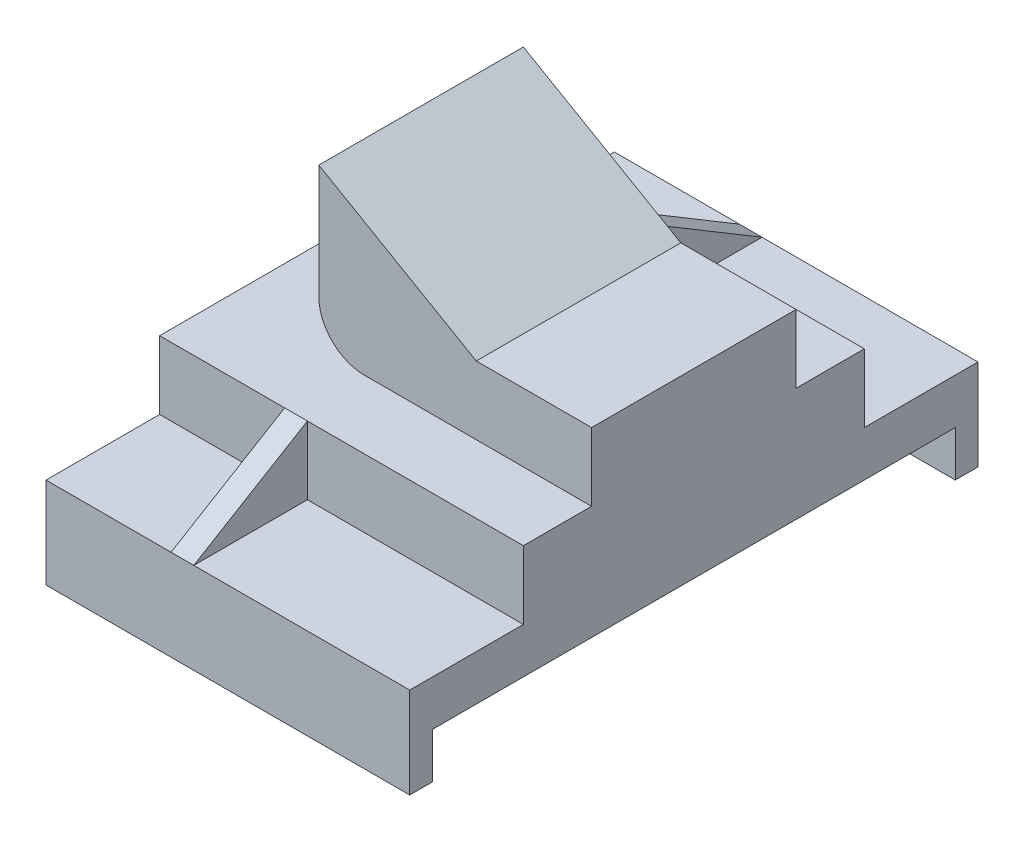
ISO-10303-21;
HEADER;
FILE_DESCRIPTION(('STEP AP214'),'2;1');
FILE_NAME('part.step','',(''),(''),'','','');
FILE_SCHEMA(('AUTOMOTIVE_DESIGN { 1 0 10303 214 1 1 1 1 }'));
ENDSEC;
DATA;
#1=APPLICATION_CONTEXT('core data for automotive mechanical design processes');
#2=APPLICATION_PROTOCOL_DEFINITION('international standard','automotive_design',2000,#1);
#3=PRODUCT_CONTEXT('',#1,'mechanical');
#4=PRODUCT('Part','Part','',(#3));
#5=PRODUCT_RELATED_PRODUCT_CATEGORY('part','',(#4));
#6=PRODUCT_DEFINITION_FORMATION('','',#4);
#7=PRODUCT_DEFINITION_CONTEXT('part definition',#1,'design');
#8=PRODUCT_DEFINITION('design','',#6,#7);
#9=PRODUCT_DEFINITION_SHAPE('','',#8);
#10=(LENGTH_UNIT() NAMED_UNIT(*) SI_UNIT(.MILLI.,.METRE.));
#11=(NAMED_UNIT(*) PLANE_ANGLE_UNIT() SI_UNIT($,.RADIAN.));
#12=(NAMED_UNIT(*) SI_UNIT($,.STERADIAN.) SOLID_ANGLE_UNIT());
#13=UNCERTAINTY_MEASURE_WITH_UNIT(LENGTH_MEASURE(1.E-05),#10,'distance_accuracy_value','');
#14=(GEOMETRIC_REPRESENTATION_CONTEXT(3) GLOBAL_UNCERTAINTY_ASSIGNED_CONTEXT((#13)) GLOBAL_UNIT_ASSIGNED_CONTEXT((#10,
#11,#12)) REPRESENTATION_CONTEXT('',''));
#15=CARTESIAN_POINT('',(0.,0.,0.));
#16=DIRECTION('',(0.,0.,1.));
#17=DIRECTION('',(1.,0.,0.));
#18=AXIS2_PLACEMENT_3D('',#15,#16,#17);
#19=CARTESIAN_POINT('',(40.,10.,-5.));
#20=DIRECTION('',(0.,0.,1.));
#21=DIRECTION('',(0.,-1.,0.));
#22=AXIS2_PLACEMENT_3D('',#19,#20,#21);
#23=PLANE('',#22);
#24=DIRECTION('',(0.,-1.,0.));
#25=VECTOR('',#24,1.);
#26=CARTESIAN_POINT('',(-7.49999999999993,10.,-5.));
#27=LINE('',#26,#25);
#28=CARTESIAN_POINT('',(-7.49999999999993,10.,-5.));
#29=VERTEX_POINT('',#28);
#30=CARTESIAN_POINT('',(-7.49999999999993,0.,-5.));
#31=VERTEX_POINT('',#30);
#32=EDGE_CURVE('E430',#29,#31,#27,.T.);
#33=ORIENTED_EDGE('',*,*,#32,.F.);
#34=DIRECTION('',(-1.,0.,0.));
#35=VECTOR('',#34,1.);
#36=CARTESIAN_POINT('',(40.,10.,-5.));
#37=LINE('',#36,#35);
#38=CARTESIAN_POINT('',(40.,10.,-5.));
#39=VERTEX_POINT('',#38);
#40=EDGE_CURVE('E238',#39,#29,#37,.T.);
#41=ORIENTED_EDGE('',*,*,#40,.F.);
#42=DIRECTION('',(0.,1.,0.));
#43=VECTOR('',#42,1.);
#44=CARTESIAN_POINT('',(40.,10.,-5.));
#45=LINE('',#44,#43);
#46=CARTESIAN_POINT('',(40.,0.,-5.));
#47=VERTEX_POINT('',#46);
#48=EDGE_CURVE('E304',#47,#39,#45,.T.);
#49=ORIENTED_EDGE('',*,*,#48,.F.);
#50=DIRECTION('',(-1.,0.,0.));
#51=VECTOR('',#50,1.);
#52=CARTESIAN_POINT('',(40.,0.,-5.));
#53=LINE('',#52,#51);
#54=EDGE_CURVE('E12',#47,#31,#53,.T.);
#55=ORIENTED_EDGE('',*,*,#54,.T.);
#56=EDGE_LOOP('',(#33,#41,#49,#55));
#57=FACE_BOUND('',#56,.T.);
#58=ADVANCED_FACE('F35',(#57),#23,.F.);
#59=CARTESIAN_POINT('',(40.,10.,-120.));
#60=DIRECTION('',(0.,1.,0.));
#61=DIRECTION('',(0.,0.,1.));
#62=AXIS2_PLACEMENT_3D('',#59,#60,#61);
#63=PLANE('',#62);
#64=DIRECTION('',(0.,0.,1.));
#65=VECTOR('',#64,1.);
#66=CARTESIAN_POINT('',(-7.49999999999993,10.,-120.));
#67=LINE('',#66,#65);
#68=CARTESIAN_POINT('',(-7.49999999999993,10.,-120.));
#69=VERTEX_POINT('',#68);
#70=EDGE_CURVE('E424',#69,#29,#67,.T.);
#71=ORIENTED_EDGE('',*,*,#70,.F.);
#72=DIRECTION('',(-1.,0.,0.));
#73=VECTOR('',#72,1.);
#74=CARTESIAN_POINT('',(40.,10.,-120.));
#75=LINE('',#74,#73);
#76=CARTESIAN_POINT('',(40.,10.,-120.));
#77=VERTEX_POINT('',#76);
#78=EDGE_CURVE('E244',#77,#69,#75,.T.);
#79=ORIENTED_EDGE('',*,*,#78,.F.);
#80=DIRECTION('',(0.,0.,-1.));
#81=VECTOR('',#80,1.);
#82=CARTESIAN_POINT('',(40.,10.,-120.));
#83=LINE('',#82,#81);
#84=EDGE_CURVE('E302',#39,#77,#83,.T.);
#85=ORIENTED_EDGE('',*,*,#84,.F.);
#86=ORIENTED_EDGE('',*,*,#40,.T.);
#87=EDGE_LOOP('',(#71,#79,#85,#86));
#88=FACE_BOUND('',#87,.T.);
#89=ADVANCED_FACE('F467',(#88),#63,.F.);
#90=CARTESIAN_POINT('',(40.,0.,-120.));
#91=DIRECTION('',(0.,0.,-1.));
#92=DIRECTION('',(-1.,0.,0.));
#93=AXIS2_PLACEMENT_3D('',#90,#91,#92);
#94=PLANE('',#93);
#95=DIRECTION('',(0.,1.,0.));
#96=VECTOR('',#95,1.);
#97=CARTESIAN_POINT('',(-7.49999999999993,0.,-120.));
#98=LINE('',#97,#96);
#99=CARTESIAN_POINT('',(-7.49999999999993,0.,-120.));
#100=VERTEX_POINT('',#99);
#101=EDGE_CURVE('E426',#100,#69,#98,.T.);
#102=ORIENTED_EDGE('',*,*,#101,.F.);
#103=DIRECTION('',(-1.,0.,0.));
#104=VECTOR('',#103,1.);
#105=CARTESIAN_POINT('',(40.,0.,-120.));
#106=LINE('',#105,#104);
#107=CARTESIAN_POINT('',(40.,0.,-120.));
#108=VERTEX_POINT('',#107);
#109=EDGE_CURVE('E249',#108,#100,#106,.T.);
#110=ORIENTED_EDGE('',*,*,#109,.F.);
#111=DIRECTION('',(0.,-1.,0.));
#112=VECTOR('',#111,1.);
#113=CARTESIAN_POINT('',(40.,0.,-120.));
#114=LINE('',#113,#112);
#115=EDGE_CURVE('E300',#77,#108,#114,.T.);
#116=ORIENTED_EDGE('',*,*,#115,.F.);
#117=ORIENTED_EDGE('',*,*,#78,.T.);
#118=EDGE_LOOP('',(#102,#110,#116,#117));
#119=FACE_BOUND('',#118,.T.);
#120=ADVANCED_FACE('F462',(#119),#94,.F.);
#121=CARTESIAN_POINT('',(40.,20.,-100.));
#122=DIRECTION('',(0.,-1.,0.));
#123=DIRECTION('',(0.,0.,-1.));
#124=AXIS2_PLACEMENT_3D('',#121,#122,#123);
#125=PLANE('',#124);
#126=DIRECTION('',(0.,0.,-1.));
#127=VECTOR('',#126,1.);
#128=CARTESIAN_POINT('',(-12.4999999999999,20.,-125.));
#129=LINE('',#128,#127);
#130=CARTESIAN_POINT('',(-12.4999999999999,20.,-100.));
#131=VERTEX_POINT('',#130);
#132=CARTESIAN_POINT('',(-12.4999999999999,20.,-125.));
#133=VERTEX_POINT('',#132);
#134=EDGE_CURVE('E58',#131,#133,#129,.T.);
#135=ORIENTED_EDGE('',*,*,#134,.T.);
#136=DIRECTION('',(-1.,0.,0.));
#137=VECTOR('',#136,1.);
#138=CARTESIAN_POINT('',(40.,20.,-125.));
#139=LINE('',#138,#137);
#140=CARTESIAN_POINT('',(-40.,20.,-125.));
#141=VERTEX_POINT('',#140);
#142=EDGE_CURVE('E259',#133,#141,#139,.T.);
#143=ORIENTED_EDGE('',*,*,#142,.T.);
#144=DIRECTION('',(0.,0.,1.));
#145=VECTOR('',#144,1.);
#146=CARTESIAN_POINT('',(-40.,20.,-100.));
#147=LINE('',#146,#145);
#148=CARTESIAN_POINT('',(-40.,20.,-100.));
#149=VERTEX_POINT('',#148);
#150=EDGE_CURVE('E323',#141,#149,#147,.T.);
#151=ORIENTED_EDGE('',*,*,#150,.T.);
#152=DIRECTION('',(-1.,0.,0.));
#153=VECTOR('',#152,1.);
#154=CARTESIAN_POINT('',(40.,20.,-100.));
#155=LINE('',#154,#153);
#156=EDGE_CURVE('E263',#131,#149,#155,.T.);
#157=ORIENTED_EDGE('',*,*,#156,.F.);
#158=EDGE_LOOP('',(#135,#143,#151,#157));
#159=FACE_BOUND('',#158,.T.);
#160=ADVANCED_FACE('F495',(#159),#125,.F.);
#161=CARTESIAN_POINT('',(40.,35.,-100.));
#162=DIRECTION('',(0.,0.,1.));
#163=DIRECTION('',(1.,0.,0.));
#164=AXIS2_PLACEMENT_3D('',#161,#162,#163);
#165=PLANE('',#164);
#166=DIRECTION('',(0.,-1.,0.));
#167=VECTOR('',#166,1.);
#168=CARTESIAN_POINT('',(-12.4999999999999,20.,-100.));
#169=LINE('',#168,#167);
#170=CARTESIAN_POINT('',(-12.4999999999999,35.,-100.));
#171=VERTEX_POINT('',#170);
#172=EDGE_CURVE('E422',#171,#131,#169,.T.);
#173=ORIENTED_EDGE('',*,*,#172,.T.);
#174=ORIENTED_EDGE('',*,*,#156,.T.);
#175=DIRECTION('',(0.,1.,0.));
#176=VECTOR('',#175,1.);
#177=CARTESIAN_POINT('',(-40.,35.,-100.));
#178=LINE('',#177,#176);
#179=CARTESIAN_POINT('',(-40.,35.,-100.));
#180=VERTEX_POINT('',#179);
#181=EDGE_CURVE('E320',#149,#180,#178,.T.);
#182=ORIENTED_EDGE('',*,*,#181,.T.);
#183=DIRECTION('',(-1.,0.,0.));
#184=VECTOR('',#183,1.);
#185=CARTESIAN_POINT('',(40.,35.,-100.));
#186=LINE('',#185,#184);
#187=EDGE_CURVE('E267',#171,#180,#186,.T.);
#188=ORIENTED_EDGE('',*,*,#187,.F.);
#189=EDGE_LOOP('',(#173,#174,#182,#188));
#190=FACE_BOUND('',#189,.T.);
#191=ADVANCED_FACE('F493',(#190),#165,.F.);
#192=CARTESIAN_POINT('',(40.,20.,-25.));
#193=DIRECTION('',(0.,0.,-1.));
#194=DIRECTION('',(-1.,0.,0.));
#195=AXIS2_PLACEMENT_3D('',#192,#193,#194);
#196=PLANE('',#195);
#197=DIRECTION('',(0.,1.,0.));
#198=VECTOR('',#197,1.);
#199=CARTESIAN_POINT('',(-12.4999999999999,35.,-25.));
#200=LINE('',#199,#198);
#201=CARTESIAN_POINT('',(-12.4999999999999,20.,-25.));
#202=VERTEX_POINT('',#201);
#203=CARTESIAN_POINT('',(-12.4999999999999,35.,-25.));
#204=VERTEX_POINT('',#203);
#205=EDGE_CURVE('E398',#202,#204,#200,.T.);
#206=ORIENTED_EDGE('',*,*,#205,.T.);
#207=DIRECTION('',(-1.,0.,0.));
#208=VECTOR('',#207,1.);
#209=CARTESIAN_POINT('',(40.,35.,-25.));
#210=LINE('',#209,#208);
#211=CARTESIAN_POINT('',(-40.,35.,-25.));
#212=VERTEX_POINT('',#211);
#213=EDGE_CURVE('E271',#204,#212,#210,.T.);
#214=ORIENTED_EDGE('',*,*,#213,.T.);
#215=DIRECTION('',(0.,-1.,0.));
#216=VECTOR('',#215,1.);
#217=CARTESIAN_POINT('',(-40.,20.,-25.));
#218=LINE('',#217,#216);
#219=CARTESIAN_POINT('',(-40.,20.,-25.));
#220=VERTEX_POINT('',#219);
#221=EDGE_CURVE('E314',#212,#220,#218,.T.);
#222=ORIENTED_EDGE('',*,*,#221,.T.);
#223=DIRECTION('',(-1.,0.,0.));
#224=VECTOR('',#223,1.);
#225=CARTESIAN_POINT('',(40.,20.,-25.));
#226=LINE('',#225,#224);
#227=EDGE_CURVE('E275',#202,#220,#226,.T.);
#228=ORIENTED_EDGE('',*,*,#227,.F.);
#229=EDGE_LOOP('',(#206,#214,#222,#228));
#230=FACE_BOUND('',#229,.T.);
#231=ADVANCED_FACE('F483',(#230),#196,.F.);
#232=CARTESIAN_POINT('',(40.,20.,0.));
#233=DIRECTION('',(0.,-1.,0.));
#234=DIRECTION('',(0.,0.,-1.));
#235=AXIS2_PLACEMENT_3D('',#232,#233,#234);
#236=PLANE('',#235);
#237=DIRECTION('',(0.,0.,-1.));
#238=VECTOR('',#237,1.);
#239=CARTESIAN_POINT('',(-12.4999999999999,20.,-25.));
#240=LINE('',#239,#238);
#241=CARTESIAN_POINT('',(-12.4999999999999,20.,0.));
#242=VERTEX_POINT('',#241);
#243=EDGE_CURVE('E401',#242,#202,#240,.T.);
#244=ORIENTED_EDGE('',*,*,#243,.T.);
#245=ORIENTED_EDGE('',*,*,#227,.T.);
#246=DIRECTION('',(0.,0.,1.));
#247=VECTOR('',#246,1.);
#248=CARTESIAN_POINT('',(-40.,20.,0.));
#249=LINE('',#248,#247);
#250=CARTESIAN_POINT('',(-40.,20.,0.));
#251=VERTEX_POINT('',#250);
#252=EDGE_CURVE('E311',#220,#251,#249,.T.);
#253=ORIENTED_EDGE('',*,*,#252,.T.);
#254=DIRECTION('',(-1.,0.,0.));
#255=VECTOR('',#254,1.);
#256=CARTESIAN_POINT('',(40.,20.,0.));
#257=LINE('',#256,#255);
#258=EDGE_CURVE('E279',#242,#251,#257,.T.);
#259=ORIENTED_EDGE('',*,*,#258,.F.);
#260=EDGE_LOOP('',(#244,#245,#253,#259));
#261=FACE_BOUND('',#260,.T.);
#262=ADVANCED_FACE('F480',(#261),#236,.F.);
#263=CARTESIAN_POINT('',(40.,35.,-25.));
#264=DIRECTION('',(0.,-1.,0.));
#265=DIRECTION('',(0.,0.,-1.));
#266=AXIS2_PLACEMENT_3D('',#263,#264,#265);
#267=PLANE('',#266);
#268=DIRECTION('',(-1.,0.,0.));
#269=VECTOR('',#268,1.);
#270=CARTESIAN_POINT('',(40.,35.,-40.));
#271=LINE('',#270,#269);
#272=CARTESIAN_POINT('',(40.,35.,-40.));
#273=VERTEX_POINT('',#272);
#274=CARTESIAN_POINT('',(-9.99999999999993,35.,-40.));
#275=VERTEX_POINT('',#274);
#276=EDGE_CURVE('E365',#273,#275,#271,.T.);
#277=ORIENTED_EDGE('',*,*,#276,.T.);
#278=DIRECTION('',(0.,0.,-1.));
#279=VECTOR('',#278,1.);
#280=CARTESIAN_POINT('',(-9.99999999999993,35.,44.462219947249));
#281=LINE('',#280,#279);
#282=CARTESIAN_POINT('',(-9.99999999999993,35.,-85.));
#283=VERTEX_POINT('',#282);
#284=EDGE_CURVE('E349',#275,#283,#281,.T.);
#285=ORIENTED_EDGE('',*,*,#284,.T.);
#286=DIRECTION('',(-1.,0.,0.));
#287=VECTOR('',#286,1.);
#288=CARTESIAN_POINT('',(40.,35.,-85.));
#289=LINE('',#288,#287);
#290=CARTESIAN_POINT('',(40.,35.,-85.));
#291=VERTEX_POINT('',#290);
#292=EDGE_CURVE('E379',#291,#283,#289,.T.);
#293=ORIENTED_EDGE('',*,*,#292,.F.);
#294=DIRECTION('',(0.,0.,1.));
#295=VECTOR('',#294,1.);
#296=CARTESIAN_POINT('',(40.,35.,-25.));
#297=LINE('',#296,#295);
#298=CARTESIAN_POINT('',(40.,35.,-100.));
#299=VERTEX_POINT('',#298);
#300=EDGE_CURVE('E288',#299,#291,#297,.T.);
#301=ORIENTED_EDGE('',*,*,#300,.F.);
#302=CARTESIAN_POINT('',(-7.49999999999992,35.,-100.));
#303=VERTEX_POINT('',#302);
#304=EDGE_CURVE('E264',#299,#303,#186,.T.);
#305=ORIENTED_EDGE('',*,*,#304,.T.);
#306=DIRECTION('',(-1.,0.,0.));
#307=VECTOR('',#306,1.);
#308=CARTESIAN_POINT('',(-7.49999999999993,35.,-100.));
#309=LINE('',#308,#307);
#310=EDGE_CURVE('E407',#303,#171,#309,.T.);
#311=ORIENTED_EDGE('',*,*,#310,.T.);
#312=ORIENTED_EDGE('',*,*,#187,.T.);
#313=DIRECTION('',(0.,0.,1.));
#314=VECTOR('',#313,1.);
#315=CARTESIAN_POINT('',(-40.,35.,-25.));
#316=LINE('',#315,#314);
#317=EDGE_CURVE('E317',#180,#212,#316,.T.);
#318=ORIENTED_EDGE('',*,*,#317,.T.);
#319=ORIENTED_EDGE('',*,*,#213,.F.);
#320=DIRECTION('',(-1.,0.,0.));
#321=VECTOR('',#320,1.);
#322=CARTESIAN_POINT('',(-7.49999999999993,35.,-25.));
#323=LINE('',#322,#321);
#324=CARTESIAN_POINT('',(-7.49999999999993,35.,-25.));
#325=VERTEX_POINT('',#324);
#326=EDGE_CURVE('E384',#325,#204,#323,.T.);
#327=ORIENTED_EDGE('',*,*,#326,.F.);
#328=CARTESIAN_POINT('',(40.,35.,-25.));
#329=VERTEX_POINT('',#328);
#330=EDGE_CURVE('E268',#329,#325,#210,.T.);
#331=ORIENTED_EDGE('',*,*,#330,.F.);
#332=EDGE_CURVE('E291',#273,#329,#297,.T.);
#333=ORIENTED_EDGE('',*,*,#332,.F.);
#334=EDGE_LOOP('',(#277,#285,#293,#301,#305,#311,#312,#318,#319,#327,#331,#333));
#335=FACE_BOUND('',#334,.T.);
#336=ADVANCED_FACE('F488',(#335),#267,.F.);
#337=CARTESIAN_POINT('',(-12.4999999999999,10.,-5.));
#338=VERTEX_POINT('',#337);
#339=CARTESIAN_POINT('',(-40.,10.,-5.));
#340=VERTEX_POINT('',#339);
#341=EDGE_CURVE('E231',#338,#340,#37,.T.);
#342=ORIENTED_EDGE('',*,*,#341,.F.);
#343=DIRECTION('',(0.,-1.,0.));
#344=VECTOR('',#343,1.);
#345=CARTESIAN_POINT('',(-12.4999999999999,10.,-5.));
#346=LINE('',#345,#344);
#347=CARTESIAN_POINT('',(-12.4999999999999,0.,-5.));
#348=VERTEX_POINT('',#347);
#349=EDGE_CURVE('E221',#338,#348,#346,.T.);
#350=ORIENTED_EDGE('',*,*,#349,.T.);
#351=CARTESIAN_POINT('',(-40.,0.,-5.));
#352=VERTEX_POINT('',#351);
#353=EDGE_CURVE('E43',#348,#352,#53,.T.);
#354=ORIENTED_EDGE('',*,*,#353,.T.);
#355=DIRECTION('',(0.,1.,0.));
#356=VECTOR('',#355,1.);
#357=CARTESIAN_POINT('',(-40.,10.,-5.));
#358=LINE('',#357,#356);
#359=EDGE_CURVE('E337',#352,#340,#358,.T.);
#360=ORIENTED_EDGE('',*,*,#359,.T.);
#361=EDGE_LOOP('',(#342,#350,#354,#360));
#362=FACE_BOUND('',#361,.T.);
#363=ADVANCED_FACE('F37',(#362),#23,.F.);
#364=CARTESIAN_POINT('',(-12.4999999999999,10.,-120.));
#365=VERTEX_POINT('',#364);
#366=CARTESIAN_POINT('',(-40.,10.,-120.));
#367=VERTEX_POINT('',#366);
#368=EDGE_CURVE('E248',#365,#367,#75,.T.);
#369=ORIENTED_EDGE('',*,*,#368,.F.);
#370=DIRECTION('',(0.,0.,1.));
#371=VECTOR('',#370,1.);
#372=CARTESIAN_POINT('',(-12.4999999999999,10.,-120.));
#373=LINE('',#372,#371);
#374=EDGE_CURVE('E433',#365,#338,#373,.T.);
#375=ORIENTED_EDGE('',*,*,#374,.T.);
#376=ORIENTED_EDGE('',*,*,#341,.T.);
#377=DIRECTION('',(0.,0.,-1.));
#378=VECTOR('',#377,1.);
#379=CARTESIAN_POINT('',(-40.,10.,-120.));
#380=LINE('',#379,#378);
#381=EDGE_CURVE('E334',#340,#367,#380,.T.);
#382=ORIENTED_EDGE('',*,*,#381,.T.);
#383=EDGE_LOOP('',(#369,#375,#376,#382));
#384=FACE_BOUND('',#383,.T.);
#385=ADVANCED_FACE('F439',(#384),#63,.F.);
#386=CARTESIAN_POINT('',(-12.4999999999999,0.,-120.));
#387=VERTEX_POINT('',#386);
#388=CARTESIAN_POINT('',(-40.,0.,-120.));
#389=VERTEX_POINT('',#388);
#390=EDGE_CURVE('E252',#387,#389,#106,.T.);
#391=ORIENTED_EDGE('',*,*,#390,.F.);
#392=DIRECTION('',(0.,1.,0.));
#393=VECTOR('',#392,1.);
#394=CARTESIAN_POINT('',(-12.4999999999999,0.,-120.));
#395=LINE('',#394,#393);
#396=EDGE_CURVE('E50',#387,#365,#395,.T.);
#397=ORIENTED_EDGE('',*,*,#396,.T.);
#398=ORIENTED_EDGE('',*,*,#368,.T.);
#399=DIRECTION('',(0.,-1.,0.));
#400=VECTOR('',#399,1.);
#401=CARTESIAN_POINT('',(-40.,0.,-120.));
#402=LINE('',#401,#400);
#403=EDGE_CURVE('E331',#367,#389,#402,.T.);
#404=ORIENTED_EDGE('',*,*,#403,.T.);
#405=EDGE_LOOP('',(#391,#397,#398,#404));
#406=FACE_BOUND('',#405,.T.);
#407=ADVANCED_FACE('F437',(#406),#94,.F.);
#408=CARTESIAN_POINT('',(40.,0.,-125.));
#409=DIRECTION('',(0.,1.,0.));
#410=DIRECTION('',(0.,0.,1.));
#411=AXIS2_PLACEMENT_3D('',#408,#409,#410);
#412=PLANE('',#411);
#413=DIRECTION('',(0.,0.,-1.));
#414=VECTOR('',#413,1.);
#415=CARTESIAN_POINT('',(-40.,0.,-125.));
#416=LINE('',#415,#414);
#417=CARTESIAN_POINT('',(-40.,0.,-125.));
#418=VERTEX_POINT('',#417);
#419=EDGE_CURVE('E329',#389,#418,#416,.T.);
#420=ORIENTED_EDGE('',*,*,#419,.T.);
#421=DIRECTION('',(-1.,0.,0.));
#422=VECTOR('',#421,1.);
#423=CARTESIAN_POINT('',(40.,0.,-125.));
#424=LINE('',#423,#422);
#425=CARTESIAN_POINT('',(40.,0.,-125.));
#426=VERTEX_POINT('',#425);
#427=EDGE_CURVE('E253',#426,#418,#424,.T.);
#428=ORIENTED_EDGE('',*,*,#427,.F.);
#429=DIRECTION('',(0.,0.,-1.));
#430=VECTOR('',#429,1.);
#431=CARTESIAN_POINT('',(40.,0.,-125.));
#432=LINE('',#431,#430);
#433=EDGE_CURVE('E298',#108,#426,#432,.T.);
#434=ORIENTED_EDGE('',*,*,#433,.F.);
#435=ORIENTED_EDGE('',*,*,#109,.T.);
#436=DIRECTION('',(0.,0.,-1.));
#437=VECTOR('',#436,1.);
#438=CARTESIAN_POINT('',(-7.49999999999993,0.,-5.));
#439=LINE('',#438,#437);
#440=EDGE_CURVE('E428',#31,#100,#439,.T.);
#441=ORIENTED_EDGE('',*,*,#440,.F.);
#442=ORIENTED_EDGE('',*,*,#54,.F.);
#443=DIRECTION('',(0.,0.,-1.));
#444=VECTOR('',#443,1.);
#445=CARTESIAN_POINT('',(40.,0.,-5.));
#446=LINE('',#445,#444);
#447=CARTESIAN_POINT('',(40.,0.,0.));
#448=VERTEX_POINT('',#447);
#449=EDGE_CURVE('E306',#448,#47,#446,.T.);
#450=ORIENTED_EDGE('',*,*,#449,.F.);
#451=DIRECTION('',(-1.,0.,0.));
#452=VECTOR('',#451,1.);
#453=CARTESIAN_POINT('',(40.,0.,0.));
#454=LINE('',#453,#452);
#455=CARTESIAN_POINT('',(-40.,0.,0.));
#456=VERTEX_POINT('',#455);
#457=EDGE_CURVE('E280',#448,#456,#454,.T.);
#458=ORIENTED_EDGE('',*,*,#457,.T.);
#459=DIRECTION('',(0.,0.,-1.));
#460=VECTOR('',#459,1.);
#461=CARTESIAN_POINT('',(-40.,0.,-5.));
#462=LINE('',#461,#460);
#463=EDGE_CURVE('E237',#456,#352,#462,.T.);
#464=ORIENTED_EDGE('',*,*,#463,.T.);
#465=ORIENTED_EDGE('',*,*,#353,.F.);
#466=DIRECTION('',(0.,0.,-1.));
#467=VECTOR('',#466,1.);
#468=CARTESIAN_POINT('',(-12.4999999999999,0.,-5.));
#469=LINE('',#468,#467);
#470=EDGE_CURVE('E218',#348,#387,#469,.T.);
#471=ORIENTED_EDGE('',*,*,#470,.T.);
#472=ORIENTED_EDGE('',*,*,#390,.T.);
#473=EDGE_LOOP('',(#420,#428,#434,#435,#441,#442,#450,#458,#464,#465,#471,#472));
#474=FACE_BOUND('',#473,.T.);
#475=ADVANCED_FACE('F234',(#474),#412,.F.);
#476=CARTESIAN_POINT('',(40.,20.,-125.));
#477=DIRECTION('',(0.,0.,1.));
#478=DIRECTION('',(1.,0.,0.));
#479=AXIS2_PLACEMENT_3D('',#476,#477,#478);
#480=PLANE('',#479);
#481=DIRECTION('',(0.,1.,0.));
#482=VECTOR('',#481,1.);
#483=CARTESIAN_POINT('',(-40.,20.,-125.));
#484=LINE('',#483,#482);
#485=EDGE_CURVE('E326',#418,#141,#484,.T.);
#486=ORIENTED_EDGE('',*,*,#485,.T.);
#487=ORIENTED_EDGE('',*,*,#142,.F.);
#488=DIRECTION('',(-1.,0.,0.));
#489=VECTOR('',#488,1.);
#490=CARTESIAN_POINT('',(-7.49999999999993,20.,-125.));
#491=LINE('',#490,#489);
#492=CARTESIAN_POINT('',(-7.49999999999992,20.,-125.));
#493=VERTEX_POINT('',#492);
#494=EDGE_CURVE('E404',#493,#133,#491,.T.);
#495=ORIENTED_EDGE('',*,*,#494,.F.);
#496=CARTESIAN_POINT('',(40.,20.,-125.));
#497=VERTEX_POINT('',#496);
#498=EDGE_CURVE('E256',#497,#493,#139,.T.);
#499=ORIENTED_EDGE('',*,*,#498,.F.);
#500=DIRECTION('',(0.,1.,0.));
#501=VECTOR('',#500,1.);
#502=CARTESIAN_POINT('',(40.,20.,-125.));
#503=LINE('',#502,#501);
#504=EDGE_CURVE('E296',#426,#497,#503,.T.);
#505=ORIENTED_EDGE('',*,*,#504,.F.);
#506=ORIENTED_EDGE('',*,*,#427,.T.);
#507=EDGE_LOOP('',(#486,#487,#495,#499,#505,#506));
#508=FACE_BOUND('',#507,.T.);
#509=ADVANCED_FACE('F451',(#508),#480,.F.);
#510=ORIENTED_EDGE('',*,*,#498,.T.);
#511=DIRECTION('',(0.,0.,-1.));
#512=VECTOR('',#511,1.);
#513=CARTESIAN_POINT('',(-7.49999999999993,20.,-125.));
#514=LINE('',#513,#512);
#515=CARTESIAN_POINT('',(-7.49999999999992,20.,-100.));
#516=VERTEX_POINT('',#515);
#517=EDGE_CURVE('E412',#516,#493,#514,.T.);
#518=ORIENTED_EDGE('',*,*,#517,.F.);
#519=CARTESIAN_POINT('',(40.,20.,-100.));
#520=VERTEX_POINT('',#519);
#521=EDGE_CURVE('E260',#520,#516,#155,.T.);
#522=ORIENTED_EDGE('',*,*,#521,.F.);
#523=DIRECTION('',(0.,0.,1.));
#524=VECTOR('',#523,1.);
#525=CARTESIAN_POINT('',(40.,20.,-100.));
#526=LINE('',#525,#524);
#527=EDGE_CURVE('E294',#497,#520,#526,.T.);
#528=ORIENTED_EDGE('',*,*,#527,.F.);
#529=EDGE_LOOP('',(#510,#518,#522,#528));
#530=FACE_BOUND('',#529,.T.);
#531=ADVANCED_FACE('F533',(#530),#125,.F.);
#532=ORIENTED_EDGE('',*,*,#521,.T.);
#533=DIRECTION('',(0.,-1.,0.));
#534=VECTOR('',#533,1.);
#535=CARTESIAN_POINT('',(-7.49999999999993,20.,-100.));
#536=LINE('',#535,#534);
#537=EDGE_CURVE('E415',#303,#516,#536,.T.);
#538=ORIENTED_EDGE('',*,*,#537,.F.);
#539=ORIENTED_EDGE('',*,*,#304,.F.);
#540=DIRECTION('',(0.,1.,0.));
#541=VECTOR('',#540,1.);
#542=CARTESIAN_POINT('',(40.,35.,-100.));
#543=LINE('',#542,#541);
#544=EDGE_CURVE('E292',#520,#299,#543,.T.);
#545=ORIENTED_EDGE('',*,*,#544,.F.);
#546=EDGE_LOOP('',(#532,#538,#539,#545));
#547=FACE_BOUND('',#546,.T.);
#548=ADVANCED_FACE('F530',(#547),#165,.F.);
#549=ORIENTED_EDGE('',*,*,#330,.T.);
#550=DIRECTION('',(0.,1.,0.));
#551=VECTOR('',#550,1.);
#552=CARTESIAN_POINT('',(-7.49999999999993,35.,-25.));
#553=LINE('',#552,#551);
#554=CARTESIAN_POINT('',(-7.49999999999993,20.,-25.));
#555=VERTEX_POINT('',#554);
#556=EDGE_CURVE('E391',#555,#325,#553,.T.);
#557=ORIENTED_EDGE('',*,*,#556,.F.);
#558=CARTESIAN_POINT('',(40.,20.,-25.));
#559=VERTEX_POINT('',#558);
#560=EDGE_CURVE('E272',#559,#555,#226,.T.);
#561=ORIENTED_EDGE('',*,*,#560,.F.);
#562=DIRECTION('',(0.,-1.,0.));
#563=VECTOR('',#562,1.);
#564=CARTESIAN_POINT('',(40.,20.,-25.));
#565=LINE('',#564,#563);
#566=EDGE_CURVE('E286',#329,#559,#565,.T.);
#567=ORIENTED_EDGE('',*,*,#566,.F.);
#568=EDGE_LOOP('',(#549,#557,#561,#567));
#569=FACE_BOUND('',#568,.T.);
#570=ADVANCED_FACE('F529',(#569),#196,.F.);
#571=ORIENTED_EDGE('',*,*,#560,.T.);
#572=DIRECTION('',(0.,0.,-1.));
#573=VECTOR('',#572,1.);
#574=CARTESIAN_POINT('',(-7.49999999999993,20.,-25.));
#575=LINE('',#574,#573);
#576=CARTESIAN_POINT('',(-7.49999999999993,20.,0.));
#577=VERTEX_POINT('',#576);
#578=EDGE_CURVE('E393',#577,#555,#575,.T.);
#579=ORIENTED_EDGE('',*,*,#578,.F.);
#580=CARTESIAN_POINT('',(40.,20.,0.));
#581=VERTEX_POINT('',#580);
#582=EDGE_CURVE('E276',#581,#577,#257,.T.);
#583=ORIENTED_EDGE('',*,*,#582,.F.);
#584=DIRECTION('',(0.,0.,1.));
#585=VECTOR('',#584,1.);
#586=CARTESIAN_POINT('',(40.,20.,0.));
#587=LINE('',#586,#585);
#588=EDGE_CURVE('E284',#559,#581,#587,.T.);
#589=ORIENTED_EDGE('',*,*,#588,.F.);
#590=EDGE_LOOP('',(#571,#579,#583,#589));
#591=FACE_BOUND('',#590,.T.);
#592=ADVANCED_FACE('F526',(#591),#236,.F.);
#593=CARTESIAN_POINT('',(40.,0.,0.));
#594=DIRECTION('',(0.,0.,-1.));
#595=DIRECTION('',(-1.,0.,0.));
#596=AXIS2_PLACEMENT_3D('',#593,#594,#595);
#597=PLANE('',#596);
#598=DIRECTION('',(0.,-1.,0.));
#599=VECTOR('',#598,1.);
#600=CARTESIAN_POINT('',(-40.,0.,0.));
#601=LINE('',#600,#599);
#602=EDGE_CURVE('E309',#251,#456,#601,.T.);
#603=ORIENTED_EDGE('',*,*,#602,.T.);
#604=ORIENTED_EDGE('',*,*,#457,.F.);
#605=DIRECTION('',(0.,-1.,0.));
#606=VECTOR('',#605,1.);
#607=CARTESIAN_POINT('',(40.,0.,0.));
#608=LINE('',#607,#606);
#609=EDGE_CURVE('E282',#581,#448,#608,.T.);
#610=ORIENTED_EDGE('',*,*,#609,.F.);
#611=ORIENTED_EDGE('',*,*,#582,.T.);
#612=DIRECTION('',(-1.,0.,0.));
#613=VECTOR('',#612,1.);
#614=CARTESIAN_POINT('',(-7.49999999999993,20.,0.));
#615=LINE('',#614,#613);
#616=EDGE_CURVE('E386',#577,#242,#615,.T.);
#617=ORIENTED_EDGE('',*,*,#616,.T.);
#618=ORIENTED_EDGE('',*,*,#258,.T.);
#619=EDGE_LOOP('',(#603,#604,#610,#611,#617,#618));
#620=FACE_BOUND('',#619,.T.);
#621=ADVANCED_FACE('F476',(#620),#597,.F.);
#622=CARTESIAN_POINT('',(40.,0.,0.));
#623=DIRECTION('',(-1.,0.,0.));
#624=DIRECTION('',(0.,0.,1.));
#625=AXIS2_PLACEMENT_3D('',#622,#623,#624);
#626=PLANE('',#625);
#627=ORIENTED_EDGE('',*,*,#449,.T.);
#628=ORIENTED_EDGE('',*,*,#48,.T.);
#629=ORIENTED_EDGE('',*,*,#84,.T.);
#630=ORIENTED_EDGE('',*,*,#115,.T.);
#631=ORIENTED_EDGE('',*,*,#433,.T.);
#632=ORIENTED_EDGE('',*,*,#504,.T.);
#633=ORIENTED_EDGE('',*,*,#527,.T.);
#634=ORIENTED_EDGE('',*,*,#544,.T.);
#635=ORIENTED_EDGE('',*,*,#300,.T.);
#636=DIRECTION('',(0.,-1.,0.));
#637=VECTOR('',#636,1.);
#638=CARTESIAN_POINT('',(40.,50.,-85.));
#639=LINE('',#638,#637);
#640=CARTESIAN_POINT('',(40.,50.,-85.));
#641=VERTEX_POINT('',#640);
#642=EDGE_CURVE('E377',#641,#291,#639,.T.);
#643=ORIENTED_EDGE('',*,*,#642,.F.);
#644=DIRECTION('',(0.,0.,-1.));
#645=VECTOR('',#644,1.);
#646=CARTESIAN_POINT('',(40.,50.,44.462219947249));
#647=LINE('',#646,#645);
#648=CARTESIAN_POINT('',(40.,50.,-40.));
#649=VERTEX_POINT('',#648);
#650=EDGE_CURVE('E352',#649,#641,#647,.T.);
#651=ORIENTED_EDGE('',*,*,#650,.F.);
#652=DIRECTION('',(0.,-1.,0.));
#653=VECTOR('',#652,1.);
#654=CARTESIAN_POINT('',(40.,50.,-40.));
#655=LINE('',#654,#653);
#656=EDGE_CURVE('E344',#649,#273,#655,.T.);
#657=ORIENTED_EDGE('',*,*,#656,.T.);
#658=ORIENTED_EDGE('',*,*,#332,.T.);
#659=ORIENTED_EDGE('',*,*,#566,.T.);
#660=ORIENTED_EDGE('',*,*,#588,.T.);
#661=ORIENTED_EDGE('',*,*,#609,.T.);
#662=EDGE_LOOP('',(#627,#628,#629,#630,#631,#632,#633,#634,#635,#643,#651,#657,#658,#659,#660,#661));
#663=FACE_BOUND('',#662,.T.);
#664=ADVANCED_FACE('F455',(#663),#626,.F.);
#665=CARTESIAN_POINT('',(-40.,0.,0.));
#666=DIRECTION('',(-1.,0.,0.));
#667=DIRECTION('',(0.,0.,1.));
#668=AXIS2_PLACEMENT_3D('',#665,#666,#667);
#669=PLANE('',#668);
#670=ORIENTED_EDGE('',*,*,#463,.F.);
#671=ORIENTED_EDGE('',*,*,#602,.F.);
#672=ORIENTED_EDGE('',*,*,#252,.F.);
#673=ORIENTED_EDGE('',*,*,#221,.F.);
#674=ORIENTED_EDGE('',*,*,#317,.F.);
#675=ORIENTED_EDGE('',*,*,#181,.F.);
#676=ORIENTED_EDGE('',*,*,#150,.F.);
#677=ORIENTED_EDGE('',*,*,#485,.F.);
#678=ORIENTED_EDGE('',*,*,#419,.F.);
#679=ORIENTED_EDGE('',*,*,#403,.F.);
#680=ORIENTED_EDGE('',*,*,#381,.F.);
#681=ORIENTED_EDGE('',*,*,#359,.F.);
#682=EDGE_LOOP('',(#670,#671,#672,#673,#674,#675,#676,#677,#678,#679,#680,#681));
#683=FACE_BOUND('',#682,.T.);
#684=ADVANCED_FACE('F444',(#683),#669,.T.);
#685=CARTESIAN_POINT('',(14.6410161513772,50.,44.462219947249));
#686=DIRECTION('',(0.,-1.,0.));
#687=DIRECTION('',(0.,0.,-1.));
#688=AXIS2_PLACEMENT_3D('',#685,#686,#687);
#689=PLANE('',#688);
#690=DIRECTION('',(0.,0.,-1.));
#691=VECTOR('',#690,1.);
#692=CARTESIAN_POINT('',(14.6410161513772,50.,44.462219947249));
#693=LINE('',#692,#691);
#694=CARTESIAN_POINT('',(14.6410161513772,50.,-40.));
#695=VERTEX_POINT('',#694);
#696=CARTESIAN_POINT('',(14.6410161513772,50.,-85.));
#697=VERTEX_POINT('',#696);
#698=EDGE_CURVE('E354',#695,#697,#693,.T.);
#699=ORIENTED_EDGE('',*,*,#698,.F.);
#700=DIRECTION('',(1.,0.,0.));
#701=VECTOR('',#700,1.);
#702=CARTESIAN_POINT('',(14.6410161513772,50.,-40.));
#703=LINE('',#702,#701);
#704=EDGE_CURVE('E341',#695,#649,#703,.T.);
#705=ORIENTED_EDGE('',*,*,#704,.T.);
#706=ORIENTED_EDGE('',*,*,#650,.T.);
#707=DIRECTION('',(1.,0.,0.));
#708=VECTOR('',#707,1.);
#709=CARTESIAN_POINT('',(14.6410161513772,50.,-85.));
#710=LINE('',#709,#708);
#711=EDGE_CURVE('E374',#697,#641,#710,.T.);
#712=ORIENTED_EDGE('',*,*,#711,.F.);
#713=EDGE_LOOP('',(#699,#705,#706,#712));
#714=FACE_BOUND('',#713,.T.);
#715=ADVANCED_FACE('F596',(#714),#689,.F.);
#716=CARTESIAN_POINT('',(-10.,45.,44.462219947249));
#717=DIRECTION('',(0.,0.,-1.));
#718=DIRECTION('',(-1.,0.,0.));
#719=AXIS2_PLACEMENT_3D('',#716,#717,#718);
#720=CYLINDRICAL_SURFACE('',#719,10.);
#721=ORIENTED_EDGE('',*,*,#284,.F.);
#722=CARTESIAN_POINT('',(-10.,45.,-40.));
#723=DIRECTION('',(0.,0.,-1.));
#724=DIRECTION('',(-1.,0.,0.));
#725=AXIS2_PLACEMENT_3D('',#722,#723,#724);
#726=CIRCLE('',#725,10.);
#727=CARTESIAN_POINT('',(-20.,45.,-40.));
#728=VERTEX_POINT('',#727);
#729=EDGE_CURVE('E362',#275,#728,#726,.T.);
#730=ORIENTED_EDGE('',*,*,#729,.T.);
#731=DIRECTION('',(0.,0.,-1.));
#732=VECTOR('',#731,1.);
#733=CARTESIAN_POINT('',(-20.,45.0000000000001,44.462219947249));
#734=LINE('',#733,#732);
#735=CARTESIAN_POINT('',(-20.,45.0000000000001,-85.));
#736=VERTEX_POINT('',#735);
#737=EDGE_CURVE('E347',#728,#736,#734,.T.);
#738=ORIENTED_EDGE('',*,*,#737,.T.);
#739=CARTESIAN_POINT('',(-10.,45.,-85.));
#740=DIRECTION('',(0.,0.,1.));
#741=DIRECTION('',(1.,0.,0.));
#742=AXIS2_PLACEMENT_3D('',#739,#740,#741);
#743=CIRCLE('',#742,10.);
#744=EDGE_CURVE('E381',#283,#736,#743,.F.);
#745=ORIENTED_EDGE('',*,*,#744,.F.);
#746=EDGE_LOOP('',(#721,#730,#738,#745));
#747=FACE_BOUND('',#746,.T.);
#748=ADVANCED_FACE('F599',(#747),#720,.T.);
#749=CARTESIAN_POINT('',(-20.,45.0000000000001,44.462219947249));
#750=DIRECTION('',(1.,0.,0.));
#751=DIRECTION('',(0.,0.,-1.));
#752=AXIS2_PLACEMENT_3D('',#749,#750,#751);
#753=PLANE('',#752);
#754=ORIENTED_EDGE('',*,*,#737,.F.);
#755=DIRECTION('',(0.,1.,0.));
#756=VECTOR('',#755,1.);
#757=CARTESIAN_POINT('',(-20.,45.0000000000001,-40.));
#758=LINE('',#757,#756);
#759=CARTESIAN_POINT('',(-20.,70.,-40.));
#760=VERTEX_POINT('',#759);
#761=EDGE_CURVE('E359',#728,#760,#758,.T.);
#762=ORIENTED_EDGE('',*,*,#761,.T.);
#763=DIRECTION('',(0.,0.,-1.));
#764=VECTOR('',#763,1.);
#765=CARTESIAN_POINT('',(-20.,70.,44.462219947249));
#766=LINE('',#765,#764);
#767=CARTESIAN_POINT('',(-20.,70.,-85.));
#768=VERTEX_POINT('',#767);
#769=EDGE_CURVE('E345',#760,#768,#766,.T.);
#770=ORIENTED_EDGE('',*,*,#769,.T.);
#771=DIRECTION('',(0.,1.,0.));
#772=VECTOR('',#771,1.);
#773=CARTESIAN_POINT('',(-20.,45.0000000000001,-85.));
#774=LINE('',#773,#772);
#775=EDGE_CURVE('E356',#736,#768,#774,.T.);
#776=ORIENTED_EDGE('',*,*,#775,.F.);
#777=EDGE_LOOP('',(#754,#762,#770,#776));
#778=FACE_BOUND('',#777,.T.);
#779=ADVANCED_FACE('F603',(#778),#753,.F.);
#780=CARTESIAN_POINT('',(-20.,70.,44.462219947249));
#781=DIRECTION('',(-0.500000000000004,-0.866025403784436,0.));
#782=DIRECTION('',(0.866025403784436,-0.500000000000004,0.));
#783=AXIS2_PLACEMENT_3D('',#780,#781,#782);
#784=PLANE('',#783);
#785=ORIENTED_EDGE('',*,*,#769,.F.);
#786=DIRECTION('',(0.866025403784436,-0.500000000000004,0.));
#787=VECTOR('',#786,1.);
#788=CARTESIAN_POINT('',(-20.,70.,-40.));
#789=LINE('',#788,#787);
#790=EDGE_CURVE('E340',#760,#695,#789,.T.);
#791=ORIENTED_EDGE('',*,*,#790,.T.);
#792=ORIENTED_EDGE('',*,*,#698,.T.);
#793=DIRECTION('',(0.866025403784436,-0.500000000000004,0.));
#794=VECTOR('',#793,1.);
#795=CARTESIAN_POINT('',(-20.,70.,-85.));
#796=LINE('',#795,#794);
#797=EDGE_CURVE('E371',#768,#697,#796,.T.);
#798=ORIENTED_EDGE('',*,*,#797,.F.);
#799=EDGE_LOOP('',(#785,#791,#792,#798));
#800=FACE_BOUND('',#799,.T.);
#801=ADVANCED_FACE('F594',(#800),#784,.F.);
#802=CARTESIAN_POINT('',(40.,20.,-40.));
#803=DIRECTION('',(0.,0.,-1.));
#804=DIRECTION('',(-1.,0.,0.));
#805=AXIS2_PLACEMENT_3D('',#802,#803,#804);
#806=PLANE('',#805);
#807=ORIENTED_EDGE('',*,*,#761,.F.);
#808=ORIENTED_EDGE('',*,*,#729,.F.);
#809=ORIENTED_EDGE('',*,*,#276,.F.);
#810=ORIENTED_EDGE('',*,*,#656,.F.);
#811=ORIENTED_EDGE('',*,*,#704,.F.);
#812=ORIENTED_EDGE('',*,*,#790,.F.);
#813=EDGE_LOOP('',(#807,#808,#809,#810,#811,#812));
#814=FACE_BOUND('',#813,.T.);
#815=ADVANCED_FACE('F590',(#814),#806,.F.);
#816=CARTESIAN_POINT('',(40.,35.,-85.));
#817=DIRECTION('',(0.,0.,1.));
#818=DIRECTION('',(1.,0.,0.));
#819=AXIS2_PLACEMENT_3D('',#816,#817,#818);
#820=PLANE('',#819);
#821=ORIENTED_EDGE('',*,*,#797,.T.);
#822=ORIENTED_EDGE('',*,*,#711,.T.);
#823=ORIENTED_EDGE('',*,*,#642,.T.);
#824=ORIENTED_EDGE('',*,*,#292,.T.);
#825=ORIENTED_EDGE('',*,*,#744,.T.);
#826=ORIENTED_EDGE('',*,*,#775,.T.);
#827=EDGE_LOOP('',(#821,#822,#823,#824,#825,#826));
#828=FACE_BOUND('',#827,.T.);
#829=ADVANCED_FACE('F587',(#828),#820,.F.);
#830=CARTESIAN_POINT('',(-7.49999999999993,20.,0.));
#831=DIRECTION('',(0.,-0.857492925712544,-0.514495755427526));
#832=DIRECTION('',(0.,0.514495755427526,-0.857492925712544));
#833=AXIS2_PLACEMENT_3D('',#830,#831,#832);
#834=PLANE('',#833);
#835=DIRECTION('',(0.,-0.514495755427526,0.857492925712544));
#836=VECTOR('',#835,1.);
#837=CARTESIAN_POINT('',(-12.4999999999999,20.,0.));
#838=LINE('',#837,#836);
#839=EDGE_CURVE('E395',#204,#242,#838,.T.);
#840=ORIENTED_EDGE('',*,*,#839,.T.);
#841=ORIENTED_EDGE('',*,*,#616,.F.);
#842=DIRECTION('',(0.,-0.514495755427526,0.857492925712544));
#843=VECTOR('',#842,1.);
#844=CARTESIAN_POINT('',(-7.49999999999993,20.,0.));
#845=LINE('',#844,#843);
#846=EDGE_CURVE('E389',#325,#577,#845,.T.);
#847=ORIENTED_EDGE('',*,*,#846,.F.);
#848=ORIENTED_EDGE('',*,*,#326,.T.);
#849=EDGE_LOOP('',(#840,#841,#847,#848));
#850=FACE_BOUND('',#849,.T.);
#851=ADVANCED_FACE('F571',(#850),#834,.F.);
#852=CARTESIAN_POINT('',(-7.49999999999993,20.,-25.));
#853=DIRECTION('',(1.,0.,0.));
#854=DIRECTION('',(0.,0.,-1.));
#855=AXIS2_PLACEMENT_3D('',#852,#853,#854);
#856=PLANE('',#855);
#857=ORIENTED_EDGE('',*,*,#578,.T.);
#858=ORIENTED_EDGE('',*,*,#556,.T.);
#859=ORIENTED_EDGE('',*,*,#846,.T.);
#860=EDGE_LOOP('',(#857,#858,#859));
#861=FACE_BOUND('',#860,.T.);
#862=ADVANCED_FACE('F575',(#861),#856,.T.);
#863=CARTESIAN_POINT('',(-12.4999999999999,20.,-25.));
#864=DIRECTION('',(1.,0.,0.));
#865=DIRECTION('',(0.,0.,-1.));
#866=AXIS2_PLACEMENT_3D('',#863,#864,#865);
#867=PLANE('',#866);
#868=ORIENTED_EDGE('',*,*,#243,.F.);
#869=ORIENTED_EDGE('',*,*,#839,.F.);
#870=ORIENTED_EDGE('',*,*,#205,.F.);
#871=EDGE_LOOP('',(#868,#869,#870));
#872=FACE_BOUND('',#871,.T.);
#873=ADVANCED_FACE('F573',(#872),#867,.F.);
#874=CARTESIAN_POINT('',(-7.49999999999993,35.,-100.));
#875=DIRECTION('',(0.,-0.857492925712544,0.514495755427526));
#876=DIRECTION('',(0.,-0.514495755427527,-0.857492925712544));
#877=AXIS2_PLACEMENT_3D('',#874,#875,#876);
#878=PLANE('',#877);
#879=DIRECTION('',(0.,0.514495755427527,0.857492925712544));
#880=VECTOR('',#879,1.);
#881=CARTESIAN_POINT('',(-12.4999999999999,35.,-100.));
#882=LINE('',#881,#880);
#883=EDGE_CURVE('E418',#133,#171,#882,.T.);
#884=ORIENTED_EDGE('',*,*,#883,.T.);
#885=ORIENTED_EDGE('',*,*,#310,.F.);
#886=DIRECTION('',(0.,0.514495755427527,0.857492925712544));
#887=VECTOR('',#886,1.);
#888=CARTESIAN_POINT('',(-7.49999999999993,35.,-100.));
#889=LINE('',#888,#887);
#890=EDGE_CURVE('E409',#493,#303,#889,.T.);
#891=ORIENTED_EDGE('',*,*,#890,.F.);
#892=ORIENTED_EDGE('',*,*,#494,.T.);
#893=EDGE_LOOP('',(#884,#885,#891,#892));
#894=FACE_BOUND('',#893,.T.);
#895=ADVANCED_FACE('F499',(#894),#878,.F.);
#896=CARTESIAN_POINT('',(-7.49999999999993,20.,-100.));
#897=DIRECTION('',(1.,0.,0.));
#898=DIRECTION('',(0.,0.,-1.));
#899=AXIS2_PLACEMENT_3D('',#896,#897,#898);
#900=PLANE('',#899);
#901=ORIENTED_EDGE('',*,*,#537,.T.);
#902=ORIENTED_EDGE('',*,*,#517,.T.);
#903=ORIENTED_EDGE('',*,*,#890,.T.);
#904=EDGE_LOOP('',(#901,#902,#903));
#905=FACE_BOUND('',#904,.T.);
#906=ADVANCED_FACE('F503',(#905),#900,.T.);
#907=CARTESIAN_POINT('',(-12.4999999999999,20.,-100.));
#908=DIRECTION('',(1.,0.,0.));
#909=DIRECTION('',(0.,0.,-1.));
#910=AXIS2_PLACEMENT_3D('',#907,#908,#909);
#911=PLANE('',#910);
#912=ORIENTED_EDGE('',*,*,#172,.F.);
#913=ORIENTED_EDGE('',*,*,#883,.F.);
#914=ORIENTED_EDGE('',*,*,#134,.F.);
#915=EDGE_LOOP('',(#912,#913,#914));
#916=FACE_BOUND('',#915,.T.);
#917=ADVANCED_FACE('F501',(#916),#911,.F.);
#918=CARTESIAN_POINT('',(-7.49999999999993,10.,-5.));
#919=DIRECTION('',(-1.,0.,0.));
#920=DIRECTION('',(0.,0.,1.));
#921=AXIS2_PLACEMENT_3D('',#918,#919,#920);
#922=PLANE('',#921);
#923=ORIENTED_EDGE('',*,*,#32,.T.);
#924=ORIENTED_EDGE('',*,*,#440,.T.);
#925=ORIENTED_EDGE('',*,*,#101,.T.);
#926=ORIENTED_EDGE('',*,*,#70,.T.);
#927=EDGE_LOOP('',(#923,#924,#925,#926));
#928=FACE_BOUND('',#927,.T.);
#929=ADVANCED_FACE('F465',(#928),#922,.F.);
#930=CARTESIAN_POINT('',(-12.4999999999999,10.,-5.));
#931=DIRECTION('',(-1.,0.,0.));
#932=DIRECTION('',(0.,0.,1.));
#933=AXIS2_PLACEMENT_3D('',#930,#931,#932);
#934=PLANE('',#933);
#935=ORIENTED_EDGE('',*,*,#349,.F.);
#936=ORIENTED_EDGE('',*,*,#374,.F.);
#937=ORIENTED_EDGE('',*,*,#396,.F.);
#938=ORIENTED_EDGE('',*,*,#470,.F.);
#939=EDGE_LOOP('',(#935,#936,#937,#938));
#940=FACE_BOUND('',#939,.T.);
#941=ADVANCED_FACE('F220',(#940),#934,.T.);
#942=CLOSED_SHELL('',(#58,#89,#120,#160,#191,#231,#262,#336,#363,#385,#407,#475,#509,#531,#548,
#570,#592,#621,#664,#684,#715,#748,#779,#801,#815,#829,#851,#862,#873,#895,#906,#917,#929,#941));
#943=MANIFOLD_SOLID_BREP('B2',#942);
#944=ADVANCED_BREP_SHAPE_REPRESENTATION('',(#18,#943),#14);
#945=SHAPE_DEFINITION_REPRESENTATION(#9,#944);
ENDSEC;
END-ISO-10303-21;
